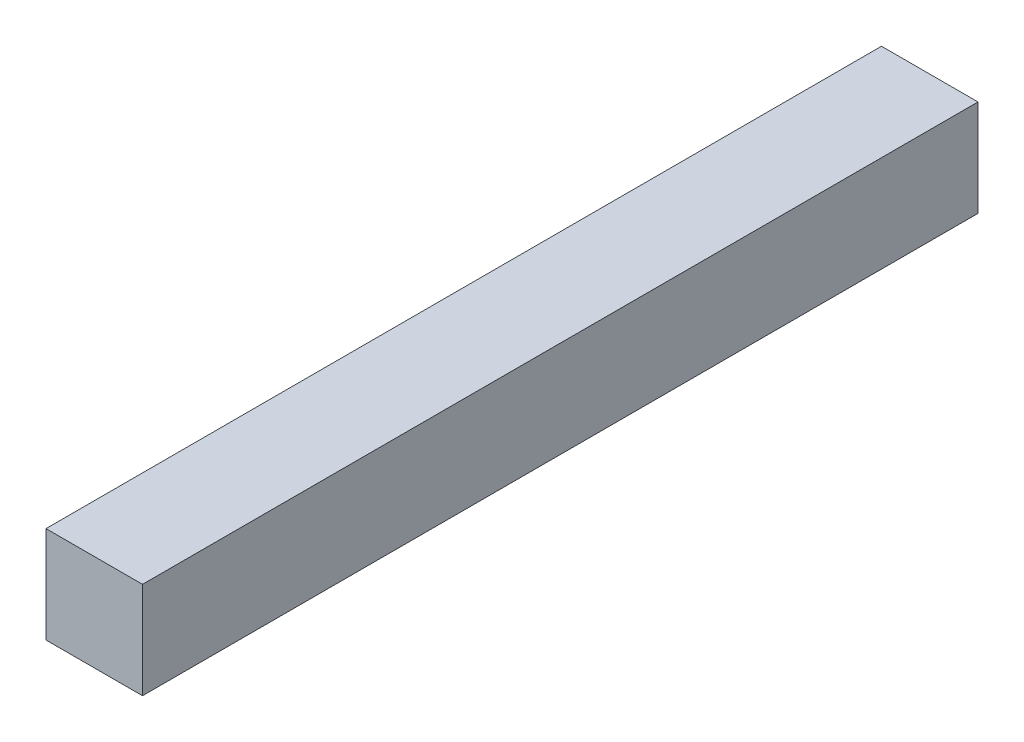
from build123d import *

# Parameters (mm, degrees)
ESQUISSE1_W        = 67
ESQUISSE1_H        = 67
BOSS_EXTRU_1_DEPTH = 580


with BuildPart() as part:
    # Esquisse1 → Boss.-Extru.1 (new body)
    with BuildSketch(Plane.XY):
        Rectangle(ESQUISSE1_W, ESQUISSE1_H)
    extrude(amount=BOSS_EXTRU_1_DEPTH)


solid = part.part
